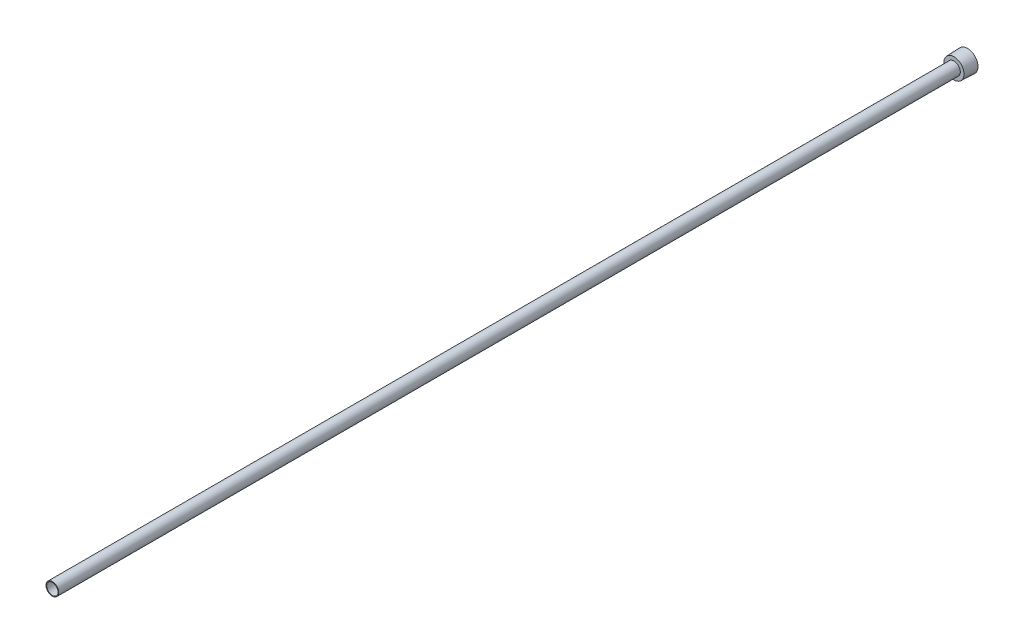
from build123d import *

# Parameters (mm, degrees)
SKETCH2_R          = 5.6388
CUT_EXTRUDE1_DEPTH = 915.521506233
CUT_EXTRUDE2_DEPTH = 9.525


with BuildPart() as part:
    # Sketch1 → Revolve1 (revolve)
    with BuildSketch(Plane(origin=(0, 0, 0), x_dir=(0, 0, -1), z_dir=(1, 0, 0)), mode=Mode.PRIVATE) as revolve1_sk:
        Polygon((0, 10.541), (-13.4874, 10.049032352), (-13.4874, 6.35), (-914.4, 6.35), (-914.4, 0), (0, 0), align=None)
    revolve(revolve1_sk.sketch.rotate(Axis((0, 0, 223.212151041), (0, 0, -1)), 90), axis=Axis((0, 0, 223.212151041), (0, 0, -1)))

    # Sketch2 → Cut-Extrude1 (cut, through all)
    with BuildSketch(Plane.XY.offset(914.4)):
        Circle(SKETCH2_R)
    extrude(amount=-CUT_EXTRUDE1_DEPTH, mode=Mode.SUBTRACT)

    # Sketch3 → Cut-Extrude2 (cut)
    with BuildSketch(Plane(origin=(0, 0, 0), x_dir=(-1, 0, 0), z_dir=(0, 0, -1))):
        Polygon((0, -7.332348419), (6.35, -3.666174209), (6.35, 3.666174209), (0, 7.332348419), (-6.35, 3.666174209), (-6.35, -3.666174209), align=None)
    extrude(amount=-CUT_EXTRUDE2_DEPTH, mode=Mode.SUBTRACT)


solid = part.part
